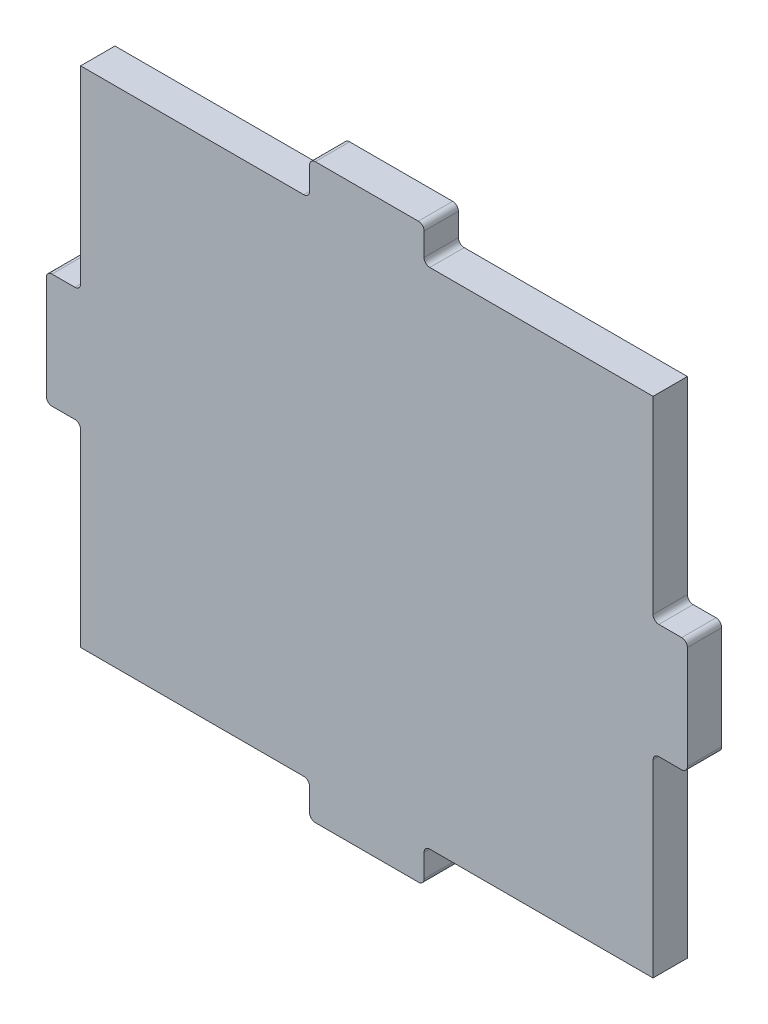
from build123d import *

# Parameters (mm, degrees)
BOSS_EXTRUDE1_DEPTH = 6
FILLET1_R           = 1


with BuildPart() as part:
    # Sketch1 → Boss-Extrude1 (new body)
    with BuildSketch(Plane.XY):
        Polygon((50, 10), (56, 10), (56, -10), (50, -10), (50, -44), (10, -44), (10, -50), (-10, -50), (-10, -44), (-50, -44), (-50, -10), (-56, -10), (-56, 10), (-50, 10), (-50, 44), (-10, 44), (-10, 50), (10, 50), (10, 44), (50, 44), align=None)
    extrude(amount=BOSS_EXTRUDE1_DEPTH)

    # Fillet1
    fillet1_edges = [part.edges().sort_by_distance(p)[0] for p in [
        (10, -44, 3),
        (10, -50, 3),
        (-10, -50, 3),
        (-10, -44, 3),
        (-50, -10, 3),
        (-56, -10, 3),
        (-56, 10, 3),
        (-50, 10, 3),
        (-10, 44, 3),
        (-10, 50, 3),
        (10, 50, 3),
        (10, 44, 3),
        (50, 10, 3),
        (56, 10, 3),
        (56, -10, 3),
        (50, -10, 3),
    ]]
    fillet(fillet1_edges, radius=FILLET1_R)


solid = part.part
